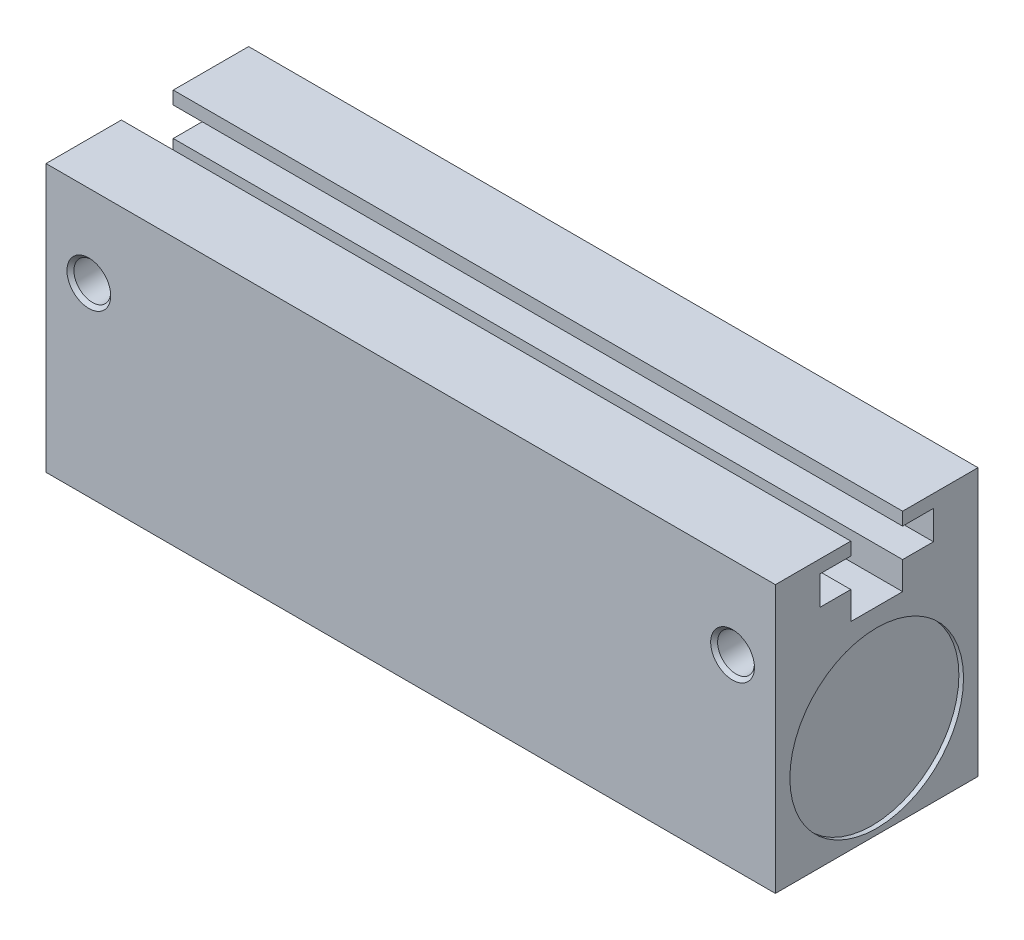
ISO-10303-21;
HEADER;
FILE_DESCRIPTION(('STEP AP214'),'2;1');
FILE_NAME('part.step','',(''),(''),'','','');
FILE_SCHEMA(('AUTOMOTIVE_DESIGN { 1 0 10303 214 1 1 1 1 }'));
ENDSEC;
DATA;
#1=APPLICATION_CONTEXT('core data for automotive mechanical design processes');
#2=APPLICATION_PROTOCOL_DEFINITION('international standard','automotive_design',2000,#1);
#3=PRODUCT_CONTEXT('',#1,'mechanical');
#4=PRODUCT('Part','Part','',(#3));
#5=PRODUCT_RELATED_PRODUCT_CATEGORY('part','',(#4));
#6=PRODUCT_DEFINITION_FORMATION('','',#4);
#7=PRODUCT_DEFINITION_CONTEXT('part definition',#1,'design');
#8=PRODUCT_DEFINITION('design','',#6,#7);
#9=PRODUCT_DEFINITION_SHAPE('','',#8);
#10=(LENGTH_UNIT() NAMED_UNIT(*) SI_UNIT(.MILLI.,.METRE.));
#11=(NAMED_UNIT(*) PLANE_ANGLE_UNIT() SI_UNIT($,.RADIAN.));
#12=(NAMED_UNIT(*) SI_UNIT($,.STERADIAN.) SOLID_ANGLE_UNIT());
#13=UNCERTAINTY_MEASURE_WITH_UNIT(LENGTH_MEASURE(1.E-05),#10,'distance_accuracy_value','');
#14=(GEOMETRIC_REPRESENTATION_CONTEXT(3) GLOBAL_UNCERTAINTY_ASSIGNED_CONTEXT((#13)) GLOBAL_UNIT_ASSIGNED_CONTEXT((#10,
#11,#12)) REPRESENTATION_CONTEXT('',''));
#15=CARTESIAN_POINT('',(0.,0.,0.));
#16=DIRECTION('',(0.,0.,1.));
#17=DIRECTION('',(1.,0.,0.));
#18=AXIS2_PLACEMENT_3D('',#15,#16,#17);
#19=CARTESIAN_POINT('',(-40.005,-14.6685,11.1125));
#20=DIRECTION('',(1.,0.,0.));
#21=DIRECTION('',(0.,0.,-1.));
#22=AXIS2_PLACEMENT_3D('',#19,#20,#21);
#23=PLANE('',#22);
#24=DIRECTION('',(0.,-1.,0.));
#25=VECTOR('',#24,1.);
#26=CARTESIAN_POINT('',(-40.005,14.6685,11.1125));
#27=LINE('',#26,#25);
#28=CARTESIAN_POINT('',(-40.005,14.6685,11.1125));
#29=VERTEX_POINT('',#28);
#30=CARTESIAN_POINT('',(-40.005,-14.6685,11.1125));
#31=VERTEX_POINT('',#30);
#32=EDGE_CURVE('E186',#29,#31,#27,.T.);
#33=ORIENTED_EDGE('',*,*,#32,.F.);
#34=DIRECTION('',(0.,0.,1.));
#35=VECTOR('',#34,1.);
#36=CARTESIAN_POINT('',(-40.005,14.6685,2.8448));
#37=LINE('',#36,#35);
#38=CARTESIAN_POINT('',(-40.005,14.6685,2.8448));
#39=VERTEX_POINT('',#38);
#40=EDGE_CURVE('E114',#39,#29,#37,.T.);
#41=ORIENTED_EDGE('',*,*,#40,.F.);
#42=DIRECTION('',(0.,1.,0.));
#43=VECTOR('',#42,1.);
#44=CARTESIAN_POINT('',(-40.005,13.2461,2.8448));
#45=LINE('',#44,#43);
#46=CARTESIAN_POINT('',(-40.005,13.2461,2.8448));
#47=VERTEX_POINT('',#46);
#48=EDGE_CURVE('E108',#47,#39,#45,.T.);
#49=ORIENTED_EDGE('',*,*,#48,.F.);
#50=DIRECTION('',(0.,0.,-1.));
#51=VECTOR('',#50,1.);
#52=CARTESIAN_POINT('',(-40.005,13.2461,6.223));
#53=LINE('',#52,#51);
#54=CARTESIAN_POINT('',(-40.005,13.2461,6.223));
#55=VERTEX_POINT('',#54);
#56=EDGE_CURVE('E176',#55,#47,#53,.T.);
#57=ORIENTED_EDGE('',*,*,#56,.F.);
#58=DIRECTION('',(0.,1.,0.));
#59=VECTOR('',#58,1.);
#60=CARTESIAN_POINT('',(-40.005,10.0711,6.223));
#61=LINE('',#60,#59);
#62=CARTESIAN_POINT('',(-40.005,10.0711,6.223));
#63=VERTEX_POINT('',#62);
#64=EDGE_CURVE('E212',#63,#55,#61,.T.);
#65=ORIENTED_EDGE('',*,*,#64,.F.);
#66=DIRECTION('',(0.,0.,1.));
#67=VECTOR('',#66,1.);
#68=CARTESIAN_POINT('',(-40.005,10.0711,2.8448));
#69=LINE('',#68,#67);
#70=CARTESIAN_POINT('',(-40.005,10.0711,2.8448));
#71=VERTEX_POINT('',#70);
#72=EDGE_CURVE('E210',#71,#63,#69,.T.);
#73=ORIENTED_EDGE('',*,*,#72,.F.);
#74=DIRECTION('',(0.,1.,0.));
#75=VECTOR('',#74,1.);
#76=CARTESIAN_POINT('',(-40.005,7.0231,2.8448));
#77=LINE('',#76,#75);
#78=CARTESIAN_POINT('',(-40.005,7.0231,2.8448));
#79=VERTEX_POINT('',#78);
#80=EDGE_CURVE('E208',#79,#71,#77,.T.);
#81=ORIENTED_EDGE('',*,*,#80,.F.);
#82=DIRECTION('',(0.,0.,1.));
#83=VECTOR('',#82,1.);
#84=CARTESIAN_POINT('',(-40.005,7.0231,-2.8448));
#85=LINE('',#84,#83);
#86=CARTESIAN_POINT('',(-40.005,7.0231,-2.8448));
#87=VERTEX_POINT('',#86);
#88=EDGE_CURVE('E206',#87,#79,#85,.T.);
#89=ORIENTED_EDGE('',*,*,#88,.F.);
#90=DIRECTION('',(0.,-1.,0.));
#91=VECTOR('',#90,1.);
#92=CARTESIAN_POINT('',(-40.005,10.0711,-2.8448));
#93=LINE('',#92,#91);
#94=CARTESIAN_POINT('',(-40.005,10.0711,-2.8448));
#95=VERTEX_POINT('',#94);
#96=EDGE_CURVE('E204',#95,#87,#93,.T.);
#97=ORIENTED_EDGE('',*,*,#96,.F.);
#98=DIRECTION('',(0.,0.,1.));
#99=VECTOR('',#98,1.);
#100=CARTESIAN_POINT('',(-40.005,10.0711,-6.223));
#101=LINE('',#100,#99);
#102=CARTESIAN_POINT('',(-40.005,10.0711,-6.223));
#103=VERTEX_POINT('',#102);
#104=EDGE_CURVE('E202',#103,#95,#101,.T.);
#105=ORIENTED_EDGE('',*,*,#104,.F.);
#106=DIRECTION('',(0.,-1.,0.));
#107=VECTOR('',#106,1.);
#108=CARTESIAN_POINT('',(-40.005,13.2461,-6.223));
#109=LINE('',#108,#107);
#110=CARTESIAN_POINT('',(-40.005,13.2461,-6.223));
#111=VERTEX_POINT('',#110);
#112=EDGE_CURVE('E200',#111,#103,#109,.T.);
#113=ORIENTED_EDGE('',*,*,#112,.F.);
#114=DIRECTION('',(0.,0.,-1.));
#115=VECTOR('',#114,1.);
#116=CARTESIAN_POINT('',(-40.005,13.2461,-2.8448));
#117=LINE('',#116,#115);
#118=CARTESIAN_POINT('',(-40.005,13.2461,-2.8448));
#119=VERTEX_POINT('',#118);
#120=EDGE_CURVE('E198',#119,#111,#117,.T.);
#121=ORIENTED_EDGE('',*,*,#120,.F.);
#122=DIRECTION('',(0.,-1.,0.));
#123=VECTOR('',#122,1.);
#124=CARTESIAN_POINT('',(-40.005,14.6685,-2.8448));
#125=LINE('',#124,#123);
#126=CARTESIAN_POINT('',(-40.005,14.6685,-2.8448));
#127=VERTEX_POINT('',#126);
#128=EDGE_CURVE('E196',#127,#119,#125,.T.);
#129=ORIENTED_EDGE('',*,*,#128,.F.);
#130=DIRECTION('',(0.,0.,1.));
#131=VECTOR('',#130,1.);
#132=CARTESIAN_POINT('',(-40.005,14.6685,-11.1125));
#133=LINE('',#132,#131);
#134=CARTESIAN_POINT('',(-40.005,14.6685,-11.1125));
#135=VERTEX_POINT('',#134);
#136=EDGE_CURVE('E194',#135,#127,#133,.T.);
#137=ORIENTED_EDGE('',*,*,#136,.F.);
#138=DIRECTION('',(0.,1.,0.));
#139=VECTOR('',#138,1.);
#140=CARTESIAN_POINT('',(-40.005,-14.6685,-11.1125));
#141=LINE('',#140,#139);
#142=CARTESIAN_POINT('',(-40.005,-14.6685,-11.1125));
#143=VERTEX_POINT('',#142);
#144=EDGE_CURVE('E192',#143,#135,#141,.T.);
#145=ORIENTED_EDGE('',*,*,#144,.F.);
#146=DIRECTION('',(0.,0.,-1.));
#147=VECTOR('',#146,1.);
#148=CARTESIAN_POINT('',(-40.005,-14.6685,11.1125));
#149=LINE('',#148,#147);
#150=EDGE_CURVE('E189',#31,#143,#149,.T.);
#151=ORIENTED_EDGE('',*,*,#150,.F.);
#152=EDGE_LOOP('',(#33,#41,#49,#57,#65,#73,#81,#89,#97,#105,#113,#121,#129,#137,#145,#151));
#153=FACE_BOUND('',#152,.T.);
#154=CARTESIAN_POINT('',(-40.005,-4.5085,0.));
#155=DIRECTION('',(1.,0.,0.));
#156=DIRECTION('',(0.,0.,-1.));
#157=AXIS2_PLACEMENT_3D('',#154,#155,#156);
#158=CIRCLE('',#157,9.525);
#159=CARTESIAN_POINT('',(-40.005,-4.5085,-9.525));
#160=VERTEX_POINT('',#159);
#161=EDGE_CURVE('E319',#160,#160,#158,.T.);
#162=ORIENTED_EDGE('',*,*,#161,.T.);
#163=EDGE_LOOP('',(#162));
#164=FACE_BOUND('',#163,.T.);
#165=ADVANCED_FACE('F37',(#153,#164),#23,.F.);
#166=CARTESIAN_POINT('',(40.005,14.6685,11.1125));
#167=DIRECTION('',(0.,0.,-1.));
#168=DIRECTION('',(0.,1.,0.));
#169=AXIS2_PLACEMENT_3D('',#166,#167,#168);
#170=PLANE('',#169);
#171=CARTESIAN_POINT('',(35.306,5.65149999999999,11.1125));
#172=DIRECTION('',(0.,0.,-1.));
#173=DIRECTION('',(0.,1.,0.));
#174=AXIS2_PLACEMENT_3D('',#171,#172,#173);
#175=CIRCLE('',#174,2.40029999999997);
#176=CARTESIAN_POINT('',(35.306,8.05179999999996,11.1125));
#177=VERTEX_POINT('',#176);
#178=EDGE_CURVE('E46',#177,#177,#175,.T.);
#179=ORIENTED_EDGE('',*,*,#178,.T.);
#180=EDGE_LOOP('',(#179));
#181=FACE_BOUND('',#180,.T.);
#182=CARTESIAN_POINT('',(-35.306,5.6515,11.1125));
#183=DIRECTION('',(0.,0.,-1.));
#184=DIRECTION('',(0.,1.,0.));
#185=AXIS2_PLACEMENT_3D('',#182,#183,#184);
#186=CIRCLE('',#185,2.40029999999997);
#187=CARTESIAN_POINT('',(-35.306,8.05179999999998,11.1125));
#188=VERTEX_POINT('',#187);
#189=EDGE_CURVE('E283',#188,#188,#186,.T.);
#190=ORIENTED_EDGE('',*,*,#189,.T.);
#191=EDGE_LOOP('',(#190));
#192=FACE_BOUND('',#191,.T.);
#193=ORIENTED_EDGE('',*,*,#32,.T.);
#194=DIRECTION('',(-1.,0.,0.));
#195=VECTOR('',#194,1.);
#196=CARTESIAN_POINT('',(40.005,-14.6685,11.1125));
#197=LINE('',#196,#195);
#198=CARTESIAN_POINT('',(40.005,-14.6685,11.1125));
#199=VERTEX_POINT('',#198);
#200=EDGE_CURVE('E254',#199,#31,#197,.T.);
#201=ORIENTED_EDGE('',*,*,#200,.F.);
#202=DIRECTION('',(0.,-1.,0.));
#203=VECTOR('',#202,1.);
#204=CARTESIAN_POINT('',(40.005,14.6685,11.1125));
#205=LINE('',#204,#203);
#206=CARTESIAN_POINT('',(40.005,14.6685,11.1125));
#207=VERTEX_POINT('',#206);
#208=EDGE_CURVE('E217',#207,#199,#205,.T.);
#209=ORIENTED_EDGE('',*,*,#208,.F.);
#210=DIRECTION('',(-1.,0.,0.));
#211=VECTOR('',#210,1.);
#212=CARTESIAN_POINT('',(40.005,14.6685,11.1125));
#213=LINE('',#212,#211);
#214=EDGE_CURVE('E182',#207,#29,#213,.T.);
#215=ORIENTED_EDGE('',*,*,#214,.T.);
#216=EDGE_LOOP('',(#193,#201,#209,#215));
#217=FACE_BOUND('',#216,.T.);
#218=ADVANCED_FACE('F288',(#181,#192,#217),#170,.F.);
#219=CARTESIAN_POINT('',(40.005,-14.6685,11.1125));
#220=DIRECTION('',(0.,1.,0.));
#221=DIRECTION('',(0.,0.,1.));
#222=AXIS2_PLACEMENT_3D('',#219,#220,#221);
#223=PLANE('',#222);
#224=CARTESIAN_POINT('',(12.7,-14.6685,8.3312));
#225=DIRECTION('',(0.,1.,0.));
#226=DIRECTION('',(0.,0.,1.));
#227=AXIS2_PLACEMENT_3D('',#224,#225,#226);
#228=CIRCLE('',#227,1.67005000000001);
#229=CARTESIAN_POINT('',(12.7,-14.6685,10.00125));
#230=VERTEX_POINT('',#229);
#231=EDGE_CURVE('E268',#230,#230,#228,.T.);
#232=ORIENTED_EDGE('',*,*,#231,.T.);
#233=EDGE_LOOP('',(#232));
#234=FACE_BOUND('',#233,.T.);
#235=CARTESIAN_POINT('',(12.7,-14.6685,-8.3312));
#236=DIRECTION('',(0.,1.,0.));
#237=DIRECTION('',(0.,0.,1.));
#238=AXIS2_PLACEMENT_3D('',#235,#236,#237);
#239=CIRCLE('',#238,1.67005000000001);
#240=CARTESIAN_POINT('',(12.7,-14.6685,-6.66114999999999));
#241=VERTEX_POINT('',#240);
#242=EDGE_CURVE('E265',#241,#241,#239,.T.);
#243=ORIENTED_EDGE('',*,*,#242,.T.);
#244=EDGE_LOOP('',(#243));
#245=FACE_BOUND('',#244,.T.);
#246=CARTESIAN_POINT('',(-12.7,-14.6685,-8.3312));
#247=DIRECTION('',(0.,1.,0.));
#248=DIRECTION('',(0.,0.,1.));
#249=AXIS2_PLACEMENT_3D('',#246,#247,#248);
#250=CIRCLE('',#249,1.67005000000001);
#251=CARTESIAN_POINT('',(-12.7,-14.6685,-6.66114999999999));
#252=VERTEX_POINT('',#251);
#253=EDGE_CURVE('E262',#252,#252,#250,.T.);
#254=ORIENTED_EDGE('',*,*,#253,.T.);
#255=EDGE_LOOP('',(#254));
#256=FACE_BOUND('',#255,.T.);
#257=CARTESIAN_POINT('',(-12.7,-14.6685,8.3312));
#258=DIRECTION('',(0.,1.,0.));
#259=DIRECTION('',(0.,0.,1.));
#260=AXIS2_PLACEMENT_3D('',#257,#258,#259);
#261=CIRCLE('',#260,1.67005000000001);
#262=CARTESIAN_POINT('',(-12.7,-14.6685,10.00125));
#263=VERTEX_POINT('',#262);
#264=EDGE_CURVE('E259',#263,#263,#261,.T.);
#265=ORIENTED_EDGE('',*,*,#264,.T.);
#266=EDGE_LOOP('',(#265));
#267=FACE_BOUND('',#266,.T.);
#268=CARTESIAN_POINT('',(0.,-14.6685,-8.3312));
#269=DIRECTION('',(0.,-1.,0.));
#270=DIRECTION('',(0.,0.,-1.));
#271=AXIS2_PLACEMENT_3D('',#268,#269,#270);
#272=CIRCLE('',#271,1.5875);
#273=CARTESIAN_POINT('',(0.,-14.6685,-9.9187));
#274=VERTEX_POINT('',#273);
#275=EDGE_CURVE('E467',#274,#274,#272,.T.);
#276=ORIENTED_EDGE('',*,*,#275,.F.);
#277=EDGE_LOOP('',(#276));
#278=FACE_BOUND('',#277,.T.);
#279=CARTESIAN_POINT('',(0.,-14.6685,8.3312));
#280=DIRECTION('',(0.,-1.,0.));
#281=DIRECTION('',(0.,0.,-1.));
#282=AXIS2_PLACEMENT_3D('',#279,#280,#281);
#283=CIRCLE('',#282,1.5875);
#284=CARTESIAN_POINT('',(0.,-14.6685,6.7437));
#285=VERTEX_POINT('',#284);
#286=EDGE_CURVE('E470',#285,#285,#283,.T.);
#287=ORIENTED_EDGE('',*,*,#286,.F.);
#288=EDGE_LOOP('',(#287));
#289=FACE_BOUND('',#288,.T.);
#290=ORIENTED_EDGE('',*,*,#150,.T.);
#291=DIRECTION('',(-1.,0.,0.));
#292=VECTOR('',#291,1.);
#293=CARTESIAN_POINT('',(40.005,-14.6685,-11.1125));
#294=LINE('',#293,#292);
#295=CARTESIAN_POINT('',(40.005,-14.6685,-11.1125));
#296=VERTEX_POINT('',#295);
#297=EDGE_CURVE('E251',#296,#143,#294,.T.);
#298=ORIENTED_EDGE('',*,*,#297,.F.);
#299=DIRECTION('',(0.,0.,-1.));
#300=VECTOR('',#299,1.);
#301=CARTESIAN_POINT('',(40.005,-14.6685,11.1125));
#302=LINE('',#301,#300);
#303=EDGE_CURVE('E123',#199,#296,#302,.T.);
#304=ORIENTED_EDGE('',*,*,#303,.F.);
#305=ORIENTED_EDGE('',*,*,#200,.T.);
#306=EDGE_LOOP('',(#290,#298,#304,#305));
#307=FACE_BOUND('',#306,.T.);
#308=ADVANCED_FACE('F379',(#234,#245,#256,#267,#278,#289,#307),#223,.F.);
#309=CARTESIAN_POINT('',(40.005,-14.6685,-11.1125));
#310=DIRECTION('',(0.,0.,1.));
#311=DIRECTION('',(0.,-1.,0.));
#312=AXIS2_PLACEMENT_3D('',#309,#310,#311);
#313=PLANE('',#312);
#314=ORIENTED_EDGE('',*,*,#144,.T.);
#315=DIRECTION('',(-1.,0.,0.));
#316=VECTOR('',#315,1.);
#317=CARTESIAN_POINT('',(40.005,14.6685,-11.1125));
#318=LINE('',#317,#316);
#319=CARTESIAN_POINT('',(40.005,14.6685,-11.1125));
#320=VERTEX_POINT('',#319);
#321=EDGE_CURVE('E248',#320,#135,#318,.T.);
#322=ORIENTED_EDGE('',*,*,#321,.F.);
#323=DIRECTION('',(0.,1.,0.));
#324=VECTOR('',#323,1.);
#325=CARTESIAN_POINT('',(40.005,-14.6685,-11.1125));
#326=LINE('',#325,#324);
#327=EDGE_CURVE('E327',#296,#320,#326,.T.);
#328=ORIENTED_EDGE('',*,*,#327,.F.);
#329=ORIENTED_EDGE('',*,*,#297,.T.);
#330=EDGE_LOOP('',(#314,#322,#328,#329));
#331=FACE_BOUND('',#330,.T.);
#332=ADVANCED_FACE('F505',(#331),#313,.F.);
#333=CARTESIAN_POINT('',(40.005,14.6685,-11.1125));
#334=DIRECTION('',(0.,-1.,0.));
#335=DIRECTION('',(0.,0.,-1.));
#336=AXIS2_PLACEMENT_3D('',#333,#334,#335);
#337=PLANE('',#336);
#338=ORIENTED_EDGE('',*,*,#136,.T.);
#339=DIRECTION('',(-1.,0.,0.));
#340=VECTOR('',#339,1.);
#341=CARTESIAN_POINT('',(40.005,14.6685,-2.8448));
#342=LINE('',#341,#340);
#343=CARTESIAN_POINT('',(40.005,14.6685,-2.8448));
#344=VERTEX_POINT('',#343);
#345=EDGE_CURVE('E245',#344,#127,#342,.T.);
#346=ORIENTED_EDGE('',*,*,#345,.F.);
#347=DIRECTION('',(0.,0.,1.));
#348=VECTOR('',#347,1.);
#349=CARTESIAN_POINT('',(40.005,14.6685,-11.1125));
#350=LINE('',#349,#348);
#351=EDGE_CURVE('E329',#320,#344,#350,.T.);
#352=ORIENTED_EDGE('',*,*,#351,.F.);
#353=ORIENTED_EDGE('',*,*,#321,.T.);
#354=EDGE_LOOP('',(#338,#346,#352,#353));
#355=FACE_BOUND('',#354,.T.);
#356=ADVANCED_FACE('F516',(#355),#337,.F.);
#357=CARTESIAN_POINT('',(40.005,14.6685,-2.8448));
#358=DIRECTION('',(0.,0.,-1.));
#359=DIRECTION('',(-1.,0.,0.));
#360=AXIS2_PLACEMENT_3D('',#357,#358,#359);
#361=PLANE('',#360);
#362=ORIENTED_EDGE('',*,*,#128,.T.);
#363=DIRECTION('',(-1.,0.,0.));
#364=VECTOR('',#363,1.);
#365=CARTESIAN_POINT('',(40.005,13.2461,-2.8448));
#366=LINE('',#365,#364);
#367=CARTESIAN_POINT('',(40.005,13.2461,-2.8448));
#368=VERTEX_POINT('',#367);
#369=EDGE_CURVE('E242',#368,#119,#366,.T.);
#370=ORIENTED_EDGE('',*,*,#369,.F.);
#371=DIRECTION('',(0.,-1.,0.));
#372=VECTOR('',#371,1.);
#373=CARTESIAN_POINT('',(40.005,14.6685,-2.8448));
#374=LINE('',#373,#372);
#375=EDGE_CURVE('E331',#344,#368,#374,.T.);
#376=ORIENTED_EDGE('',*,*,#375,.F.);
#377=ORIENTED_EDGE('',*,*,#345,.T.);
#378=EDGE_LOOP('',(#362,#370,#376,#377));
#379=FACE_BOUND('',#378,.T.);
#380=ADVANCED_FACE('F520',(#379),#361,.F.);
#381=CARTESIAN_POINT('',(40.005,13.2461,-2.8448));
#382=DIRECTION('',(0.,1.,0.));
#383=DIRECTION('',(0.,0.,1.));
#384=AXIS2_PLACEMENT_3D('',#381,#382,#383);
#385=PLANE('',#384);
#386=ORIENTED_EDGE('',*,*,#120,.T.);
#387=DIRECTION('',(-1.,0.,0.));
#388=VECTOR('',#387,1.);
#389=CARTESIAN_POINT('',(40.005,13.2461,-6.223));
#390=LINE('',#389,#388);
#391=CARTESIAN_POINT('',(40.005,13.2461,-6.223));
#392=VERTEX_POINT('',#391);
#393=EDGE_CURVE('E239',#392,#111,#390,.T.);
#394=ORIENTED_EDGE('',*,*,#393,.F.);
#395=DIRECTION('',(0.,0.,-1.));
#396=VECTOR('',#395,1.);
#397=CARTESIAN_POINT('',(40.005,13.2461,-2.8448));
#398=LINE('',#397,#396);
#399=EDGE_CURVE('E333',#368,#392,#398,.T.);
#400=ORIENTED_EDGE('',*,*,#399,.F.);
#401=ORIENTED_EDGE('',*,*,#369,.T.);
#402=EDGE_LOOP('',(#386,#394,#400,#401));
#403=FACE_BOUND('',#402,.T.);
#404=ADVANCED_FACE('F527',(#403),#385,.F.);
#405=CARTESIAN_POINT('',(40.005,13.2461,-6.223));
#406=DIRECTION('',(0.,0.,-1.));
#407=DIRECTION('',(-1.,0.,0.));
#408=AXIS2_PLACEMENT_3D('',#405,#406,#407);
#409=PLANE('',#408);
#410=ORIENTED_EDGE('',*,*,#112,.T.);
#411=DIRECTION('',(-1.,0.,0.));
#412=VECTOR('',#411,1.);
#413=CARTESIAN_POINT('',(40.005,10.0711,-6.223));
#414=LINE('',#413,#412);
#415=CARTESIAN_POINT('',(40.005,10.0711,-6.223));
#416=VERTEX_POINT('',#415);
#417=EDGE_CURVE('E236',#416,#103,#414,.T.);
#418=ORIENTED_EDGE('',*,*,#417,.F.);
#419=DIRECTION('',(0.,-1.,0.));
#420=VECTOR('',#419,1.);
#421=CARTESIAN_POINT('',(40.005,13.2461,-6.223));
#422=LINE('',#421,#420);
#423=EDGE_CURVE('E335',#392,#416,#422,.T.);
#424=ORIENTED_EDGE('',*,*,#423,.F.);
#425=ORIENTED_EDGE('',*,*,#393,.T.);
#426=EDGE_LOOP('',(#410,#418,#424,#425));
#427=FACE_BOUND('',#426,.T.);
#428=ADVANCED_FACE('F530',(#427),#409,.F.);
#429=CARTESIAN_POINT('',(40.005,10.0711,-6.223));
#430=DIRECTION('',(0.,-1.,0.));
#431=DIRECTION('',(0.,0.,-1.));
#432=AXIS2_PLACEMENT_3D('',#429,#430,#431);
#433=PLANE('',#432);
#434=ORIENTED_EDGE('',*,*,#104,.T.);
#435=DIRECTION('',(-1.,0.,0.));
#436=VECTOR('',#435,1.);
#437=CARTESIAN_POINT('',(40.005,10.0711,-2.8448));
#438=LINE('',#437,#436);
#439=CARTESIAN_POINT('',(40.005,10.0711,-2.8448));
#440=VERTEX_POINT('',#439);
#441=EDGE_CURVE('E233',#440,#95,#438,.T.);
#442=ORIENTED_EDGE('',*,*,#441,.F.);
#443=DIRECTION('',(0.,0.,1.));
#444=VECTOR('',#443,1.);
#445=CARTESIAN_POINT('',(40.005,10.0711,-6.223));
#446=LINE('',#445,#444);
#447=EDGE_CURVE('E337',#416,#440,#446,.T.);
#448=ORIENTED_EDGE('',*,*,#447,.F.);
#449=ORIENTED_EDGE('',*,*,#417,.T.);
#450=EDGE_LOOP('',(#434,#442,#448,#449));
#451=FACE_BOUND('',#450,.T.);
#452=ADVANCED_FACE('F535',(#451),#433,.F.);
#453=CARTESIAN_POINT('',(40.005,10.0711,-2.8448));
#454=DIRECTION('',(0.,0.,-1.));
#455=DIRECTION('',(-1.,0.,0.));
#456=AXIS2_PLACEMENT_3D('',#453,#454,#455);
#457=PLANE('',#456);
#458=ORIENTED_EDGE('',*,*,#96,.T.);
#459=DIRECTION('',(-1.,0.,0.));
#460=VECTOR('',#459,1.);
#461=CARTESIAN_POINT('',(40.005,7.0231,-2.8448));
#462=LINE('',#461,#460);
#463=CARTESIAN_POINT('',(40.005,7.0231,-2.8448));
#464=VERTEX_POINT('',#463);
#465=EDGE_CURVE('E230',#464,#87,#462,.T.);
#466=ORIENTED_EDGE('',*,*,#465,.F.);
#467=DIRECTION('',(0.,-1.,0.));
#468=VECTOR('',#467,1.);
#469=CARTESIAN_POINT('',(40.005,10.0711,-2.8448));
#470=LINE('',#469,#468);
#471=EDGE_CURVE('E339',#440,#464,#470,.T.);
#472=ORIENTED_EDGE('',*,*,#471,.F.);
#473=ORIENTED_EDGE('',*,*,#441,.T.);
#474=EDGE_LOOP('',(#458,#466,#472,#473));
#475=FACE_BOUND('',#474,.T.);
#476=ADVANCED_FACE('F541',(#475),#457,.F.);
#477=CARTESIAN_POINT('',(40.005,7.0231,-2.8448));
#478=DIRECTION('',(0.,-1.,0.));
#479=DIRECTION('',(0.,0.,-1.));
#480=AXIS2_PLACEMENT_3D('',#477,#478,#479);
#481=PLANE('',#480);
#482=ORIENTED_EDGE('',*,*,#88,.T.);
#483=DIRECTION('',(-1.,0.,0.));
#484=VECTOR('',#483,1.);
#485=CARTESIAN_POINT('',(40.005,7.0231,2.8448));
#486=LINE('',#485,#484);
#487=CARTESIAN_POINT('',(40.005,7.0231,2.8448));
#488=VERTEX_POINT('',#487);
#489=EDGE_CURVE('E227',#488,#79,#486,.T.);
#490=ORIENTED_EDGE('',*,*,#489,.F.);
#491=DIRECTION('',(0.,0.,1.));
#492=VECTOR('',#491,1.);
#493=CARTESIAN_POINT('',(40.005,7.0231,-2.8448));
#494=LINE('',#493,#492);
#495=EDGE_CURVE('E341',#464,#488,#494,.T.);
#496=ORIENTED_EDGE('',*,*,#495,.F.);
#497=ORIENTED_EDGE('',*,*,#465,.T.);
#498=EDGE_LOOP('',(#482,#490,#496,#497));
#499=FACE_BOUND('',#498,.T.);
#500=ADVANCED_FACE('F545',(#499),#481,.F.);
#501=CARTESIAN_POINT('',(40.005,7.0231,2.8448));
#502=DIRECTION('',(0.,0.,1.));
#503=DIRECTION('',(1.,0.,0.));
#504=AXIS2_PLACEMENT_3D('',#501,#502,#503);
#505=PLANE('',#504);
#506=ORIENTED_EDGE('',*,*,#80,.T.);
#507=DIRECTION('',(-1.,0.,0.));
#508=VECTOR('',#507,1.);
#509=CARTESIAN_POINT('',(40.005,10.0711,2.8448));
#510=LINE('',#509,#508);
#511=CARTESIAN_POINT('',(40.005,10.0711,2.8448));
#512=VERTEX_POINT('',#511);
#513=EDGE_CURVE('E224',#512,#71,#510,.T.);
#514=ORIENTED_EDGE('',*,*,#513,.F.);
#515=DIRECTION('',(0.,1.,0.));
#516=VECTOR('',#515,1.);
#517=CARTESIAN_POINT('',(40.005,7.0231,2.8448));
#518=LINE('',#517,#516);
#519=EDGE_CURVE('E343',#488,#512,#518,.T.);
#520=ORIENTED_EDGE('',*,*,#519,.F.);
#521=ORIENTED_EDGE('',*,*,#489,.T.);
#522=EDGE_LOOP('',(#506,#514,#520,#521));
#523=FACE_BOUND('',#522,.T.);
#524=ADVANCED_FACE('F548',(#523),#505,.F.);
#525=CARTESIAN_POINT('',(40.005,10.0711,2.8448));
#526=DIRECTION('',(0.,-1.,0.));
#527=DIRECTION('',(0.,0.,-1.));
#528=AXIS2_PLACEMENT_3D('',#525,#526,#527);
#529=PLANE('',#528);
#530=ORIENTED_EDGE('',*,*,#72,.T.);
#531=DIRECTION('',(-1.,0.,0.));
#532=VECTOR('',#531,1.);
#533=CARTESIAN_POINT('',(40.005,10.0711,6.223));
#534=LINE('',#533,#532);
#535=CARTESIAN_POINT('',(40.005,10.0711,6.223));
#536=VERTEX_POINT('',#535);
#537=EDGE_CURVE('E221',#536,#63,#534,.T.);
#538=ORIENTED_EDGE('',*,*,#537,.F.);
#539=DIRECTION('',(0.,0.,1.));
#540=VECTOR('',#539,1.);
#541=CARTESIAN_POINT('',(40.005,10.0711,2.8448));
#542=LINE('',#541,#540);
#543=EDGE_CURVE('E345',#512,#536,#542,.T.);
#544=ORIENTED_EDGE('',*,*,#543,.F.);
#545=ORIENTED_EDGE('',*,*,#513,.T.);
#546=EDGE_LOOP('',(#530,#538,#544,#545));
#547=FACE_BOUND('',#546,.T.);
#548=ADVANCED_FACE('F351',(#547),#529,.F.);
#549=CARTESIAN_POINT('',(40.005,10.0711,6.223));
#550=DIRECTION('',(0.,0.,1.));
#551=DIRECTION('',(1.,0.,0.));
#552=AXIS2_PLACEMENT_3D('',#549,#550,#551);
#553=PLANE('',#552);
#554=ORIENTED_EDGE('',*,*,#64,.T.);
#555=DIRECTION('',(-1.,0.,0.));
#556=VECTOR('',#555,1.);
#557=CARTESIAN_POINT('',(40.005,13.2461,6.223));
#558=LINE('',#557,#556);
#559=CARTESIAN_POINT('',(40.005,13.2461,6.223));
#560=VERTEX_POINT('',#559);
#561=EDGE_CURVE('E177',#560,#55,#558,.T.);
#562=ORIENTED_EDGE('',*,*,#561,.F.);
#563=DIRECTION('',(0.,1.,0.));
#564=VECTOR('',#563,1.);
#565=CARTESIAN_POINT('',(40.005,10.0711,6.223));
#566=LINE('',#565,#564);
#567=EDGE_CURVE('E168',#536,#560,#566,.T.);
#568=ORIENTED_EDGE('',*,*,#567,.F.);
#569=ORIENTED_EDGE('',*,*,#537,.T.);
#570=EDGE_LOOP('',(#554,#562,#568,#569));
#571=FACE_BOUND('',#570,.T.);
#572=ADVANCED_FACE('F355',(#571),#553,.F.);
#573=CARTESIAN_POINT('',(40.005,13.2461,6.223));
#574=DIRECTION('',(0.,1.,0.));
#575=DIRECTION('',(0.,0.,1.));
#576=AXIS2_PLACEMENT_3D('',#573,#574,#575);
#577=PLANE('',#576);
#578=ORIENTED_EDGE('',*,*,#56,.T.);
#579=DIRECTION('',(-1.,0.,0.));
#580=VECTOR('',#579,1.);
#581=CARTESIAN_POINT('',(40.005,13.2461,2.8448));
#582=LINE('',#581,#580);
#583=CARTESIAN_POINT('',(40.005,13.2461,2.8448));
#584=VERTEX_POINT('',#583);
#585=EDGE_CURVE('E173',#584,#47,#582,.T.);
#586=ORIENTED_EDGE('',*,*,#585,.F.);
#587=DIRECTION('',(0.,0.,-1.));
#588=VECTOR('',#587,1.);
#589=CARTESIAN_POINT('',(40.005,13.2461,6.223));
#590=LINE('',#589,#588);
#591=EDGE_CURVE('E162',#560,#584,#590,.T.);
#592=ORIENTED_EDGE('',*,*,#591,.F.);
#593=ORIENTED_EDGE('',*,*,#561,.T.);
#594=EDGE_LOOP('',(#578,#586,#592,#593));
#595=FACE_BOUND('',#594,.T.);
#596=ADVANCED_FACE('F174',(#595),#577,.F.);
#597=CARTESIAN_POINT('',(40.005,13.2461,2.8448));
#598=DIRECTION('',(0.,0.,1.));
#599=DIRECTION('',(1.,0.,0.));
#600=AXIS2_PLACEMENT_3D('',#597,#598,#599);
#601=PLANE('',#600);
#602=ORIENTED_EDGE('',*,*,#48,.T.);
#603=DIRECTION('',(-1.,0.,0.));
#604=VECTOR('',#603,1.);
#605=CARTESIAN_POINT('',(40.005,14.6685,2.8448));
#606=LINE('',#605,#604);
#607=CARTESIAN_POINT('',(40.005,14.6685,2.8448));
#608=VERTEX_POINT('',#607);
#609=EDGE_CURVE('E178',#608,#39,#606,.T.);
#610=ORIENTED_EDGE('',*,*,#609,.F.);
#611=DIRECTION('',(0.,1.,0.));
#612=VECTOR('',#611,1.);
#613=CARTESIAN_POINT('',(40.005,13.2461,2.8448));
#614=LINE('',#613,#612);
#615=EDGE_CURVE('E166',#584,#608,#614,.T.);
#616=ORIENTED_EDGE('',*,*,#615,.F.);
#617=ORIENTED_EDGE('',*,*,#585,.T.);
#618=EDGE_LOOP('',(#602,#610,#616,#617));
#619=FACE_BOUND('',#618,.T.);
#620=ADVANCED_FACE('F180',(#619),#601,.F.);
#621=CARTESIAN_POINT('',(40.005,14.6685,2.8448));
#622=DIRECTION('',(0.,-1.,0.));
#623=DIRECTION('',(0.,0.,-1.));
#624=AXIS2_PLACEMENT_3D('',#621,#622,#623);
#625=PLANE('',#624);
#626=ORIENTED_EDGE('',*,*,#40,.T.);
#627=ORIENTED_EDGE('',*,*,#214,.F.);
#628=DIRECTION('',(0.,0.,1.));
#629=VECTOR('',#628,1.);
#630=CARTESIAN_POINT('',(40.005,14.6685,2.8448));
#631=LINE('',#630,#629);
#632=EDGE_CURVE('E54',#608,#207,#631,.T.);
#633=ORIENTED_EDGE('',*,*,#632,.F.);
#634=ORIENTED_EDGE('',*,*,#609,.T.);
#635=EDGE_LOOP('',(#626,#627,#633,#634));
#636=FACE_BOUND('',#635,.T.);
#637=ADVANCED_FACE('F363',(#636),#625,.F.);
#638=CARTESIAN_POINT('',(40.005,-14.6685,11.1125));
#639=DIRECTION('',(1.,0.,0.));
#640=DIRECTION('',(0.,0.,-1.));
#641=AXIS2_PLACEMENT_3D('',#638,#639,#640);
#642=PLANE('',#641);
#643=CARTESIAN_POINT('',(40.005,-4.5085,0.));
#644=DIRECTION('',(1.,0.,0.));
#645=DIRECTION('',(0.,0.,-1.));
#646=AXIS2_PLACEMENT_3D('',#643,#644,#645);
#647=CIRCLE('',#646,9.525);
#648=CARTESIAN_POINT('',(40.005,-4.5085,-9.525));
#649=VERTEX_POINT('',#648);
#650=EDGE_CURVE('E307',#649,#649,#647,.T.);
#651=ORIENTED_EDGE('',*,*,#650,.F.);
#652=EDGE_LOOP('',(#651));
#653=FACE_BOUND('',#652,.T.);
#654=ORIENTED_EDGE('',*,*,#208,.T.);
#655=ORIENTED_EDGE('',*,*,#303,.T.);
#656=ORIENTED_EDGE('',*,*,#327,.T.);
#657=ORIENTED_EDGE('',*,*,#351,.T.);
#658=ORIENTED_EDGE('',*,*,#375,.T.);
#659=ORIENTED_EDGE('',*,*,#399,.T.);
#660=ORIENTED_EDGE('',*,*,#423,.T.);
#661=ORIENTED_EDGE('',*,*,#447,.T.);
#662=ORIENTED_EDGE('',*,*,#471,.T.);
#663=ORIENTED_EDGE('',*,*,#495,.T.);
#664=ORIENTED_EDGE('',*,*,#519,.T.);
#665=ORIENTED_EDGE('',*,*,#543,.T.);
#666=ORIENTED_EDGE('',*,*,#567,.T.);
#667=ORIENTED_EDGE('',*,*,#591,.T.);
#668=ORIENTED_EDGE('',*,*,#615,.T.);
#669=ORIENTED_EDGE('',*,*,#632,.T.);
#670=EDGE_LOOP('',(#654,#655,#656,#657,#658,#659,#660,#661,#662,#663,#664,#665,#666,#667,#668,#669));
#671=FACE_BOUND('',#670,.T.);
#672=ADVANCED_FACE('F164',(#653,#671),#642,.T.);
#673=CARTESIAN_POINT('',(-39.497,-4.5085,0.));
#674=DIRECTION('',(-1.,0.,0.));
#675=DIRECTION('',(0.,0.,1.));
#676=AXIS2_PLACEMENT_3D('',#673,#674,#675);
#677=CYLINDRICAL_SURFACE('',#676,9.525);
#678=CARTESIAN_POINT('',(-39.497,-4.5085,0.));
#679=DIRECTION('',(1.,0.,0.));
#680=DIRECTION('',(0.,0.,-1.));
#681=AXIS2_PLACEMENT_3D('',#678,#679,#680);
#682=CIRCLE('',#681,9.525);
#683=CARTESIAN_POINT('',(-39.497,-4.5085,-9.525));
#684=VERTEX_POINT('',#683);
#685=EDGE_CURVE('E190',#684,#684,#682,.T.);
#686=ORIENTED_EDGE('',*,*,#685,.T.);
#687=EDGE_LOOP('',(#686));
#688=FACE_BOUND('',#687,.T.);
#689=ORIENTED_EDGE('',*,*,#161,.F.);
#690=EDGE_LOOP('',(#689));
#691=FACE_BOUND('',#690,.T.);
#692=ADVANCED_FACE('F370',(#688,#691),#677,.F.);
#693=CARTESIAN_POINT('',(-39.497,-4.5085,0.));
#694=DIRECTION('',(1.,0.,0.));
#695=DIRECTION('',(0.,0.,-1.));
#696=AXIS2_PLACEMENT_3D('',#693,#694,#695);
#697=PLANE('',#696);
#698=ORIENTED_EDGE('',*,*,#685,.F.);
#699=EDGE_LOOP('',(#698));
#700=FACE_BOUND('',#699,.T.);
#701=ADVANCED_FACE('F384',(#700),#697,.F.);
#702=CARTESIAN_POINT('',(39.497,-4.5085,0.));
#703=DIRECTION('',(1.,0.,0.));
#704=DIRECTION('',(0.,0.,-1.));
#705=AXIS2_PLACEMENT_3D('',#702,#703,#704);
#706=CYLINDRICAL_SURFACE('',#705,9.525);
#707=CARTESIAN_POINT('',(39.497,-4.5085,0.));
#708=DIRECTION('',(1.,0.,0.));
#709=DIRECTION('',(0.,0.,-1.));
#710=AXIS2_PLACEMENT_3D('',#707,#708,#709);
#711=CIRCLE('',#710,9.525);
#712=CARTESIAN_POINT('',(39.497,-4.5085,-9.525));
#713=VERTEX_POINT('',#712);
#714=EDGE_CURVE('E311',#713,#713,#711,.T.);
#715=ORIENTED_EDGE('',*,*,#714,.F.);
#716=EDGE_LOOP('',(#715));
#717=FACE_BOUND('',#716,.T.);
#718=ORIENTED_EDGE('',*,*,#650,.T.);
#719=EDGE_LOOP('',(#718));
#720=FACE_BOUND('',#719,.T.);
#721=ADVANCED_FACE('F388',(#717,#720),#706,.F.);
#722=CARTESIAN_POINT('',(39.497,-4.5085,0.));
#723=DIRECTION('',(-1.,0.,0.));
#724=DIRECTION('',(0.,0.,-1.));
#725=AXIS2_PLACEMENT_3D('',#722,#723,#724);
#726=PLANE('',#725);
#727=ORIENTED_EDGE('',*,*,#714,.T.);
#728=EDGE_LOOP('',(#727));
#729=FACE_BOUND('',#728,.T.);
#730=ADVANCED_FACE('F392',(#729),#726,.F.);
#731=CARTESIAN_POINT('',(35.306,5.65149999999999,6.223));
#732=DIRECTION('',(0.,0.,1.));
#733=DIRECTION('',(1.,0.,0.));
#734=AXIS2_PLACEMENT_3D('',#731,#732,#733);
#735=CONICAL_SURFACE('',#734,2.0193,1.02974425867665);
#736=CARTESIAN_POINT('',(35.306,5.65149999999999,5.00968215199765));
#737=VERTEX_POINT('',#736);
#738=VERTEX_LOOP('',#737);
#739=FACE_BOUND('',#738,.T.);
#740=CARTESIAN_POINT('',(35.306,5.65149999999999,6.223));
#741=DIRECTION('',(0.,0.,1.));
#742=DIRECTION('',(1.,0.,0.));
#743=AXIS2_PLACEMENT_3D('',#740,#741,#742);
#744=CIRCLE('',#743,2.0193);
#745=CARTESIAN_POINT('',(37.3253,5.65149999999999,6.223));
#746=VERTEX_POINT('',#745);
#747=EDGE_CURVE('E305',#746,#746,#744,.T.);
#748=ORIENTED_EDGE('',*,*,#747,.T.);
#749=EDGE_LOOP('',(#748));
#750=FACE_BOUND('',#749,.T.);
#751=ADVANCED_FACE('F301',(#739,#750),#735,.F.);
#752=CARTESIAN_POINT('',(35.306,5.65149999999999,11.1125));
#753=DIRECTION('',(0.,0.,1.));
#754=DIRECTION('',(1.,0.,0.));
#755=AXIS2_PLACEMENT_3D('',#752,#753,#754);
#756=CYLINDRICAL_SURFACE('',#755,2.01929999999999);
#757=CARTESIAN_POINT('',(35.306,5.65149999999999,10.7315));
#758=DIRECTION('',(0.,0.,-1.));
#759=DIRECTION('',(-1.,0.,0.));
#760=AXIS2_PLACEMENT_3D('',#757,#758,#759);
#761=CIRCLE('',#760,2.01929999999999);
#762=CARTESIAN_POINT('',(33.2867,5.65149999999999,10.7315));
#763=VERTEX_POINT('',#762);
#764=EDGE_CURVE('E280',#763,#763,#761,.F.);
#765=ORIENTED_EDGE('',*,*,#764,.T.);
#766=EDGE_LOOP('',(#765));
#767=FACE_BOUND('',#766,.T.);
#768=ORIENTED_EDGE('',*,*,#747,.F.);
#769=EDGE_LOOP('',(#768));
#770=FACE_BOUND('',#769,.T.);
#771=ADVANCED_FACE('F297',(#767,#770),#756,.F.);
#772=CARTESIAN_POINT('',(-35.306,5.6515,6.223));
#773=DIRECTION('',(0.,0.,1.));
#774=DIRECTION('',(1.,0.,0.));
#775=AXIS2_PLACEMENT_3D('',#772,#773,#774);
#776=CONICAL_SURFACE('',#775,2.0193,1.02974425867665);
#777=CARTESIAN_POINT('',(-35.306,5.6515,5.00968215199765));
#778=VERTEX_POINT('',#777);
#779=VERTEX_LOOP('',#778);
#780=FACE_BOUND('',#779,.T.);
#781=CARTESIAN_POINT('',(-35.306,5.6515,6.223));
#782=DIRECTION('',(0.,0.,1.));
#783=DIRECTION('',(1.,0.,0.));
#784=AXIS2_PLACEMENT_3D('',#781,#782,#783);
#785=CIRCLE('',#784,2.0193);
#786=CARTESIAN_POINT('',(-33.2867,5.6515,6.223));
#787=VERTEX_POINT('',#786);
#788=EDGE_CURVE('E308',#787,#787,#785,.T.);
#789=ORIENTED_EDGE('',*,*,#788,.T.);
#790=EDGE_LOOP('',(#789));
#791=FACE_BOUND('',#790,.T.);
#792=ADVANCED_FACE('F300',(#780,#791),#776,.F.);
#793=CARTESIAN_POINT('',(-35.306,5.6515,11.1125));
#794=DIRECTION('',(0.,0.,1.));
#795=DIRECTION('',(1.,0.,0.));
#796=AXIS2_PLACEMENT_3D('',#793,#794,#795);
#797=CYLINDRICAL_SURFACE('',#796,2.01929999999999);
#798=CARTESIAN_POINT('',(-35.306,5.6515,10.7315));
#799=DIRECTION('',(0.,0.,-1.));
#800=DIRECTION('',(-1.,0.,0.));
#801=AXIS2_PLACEMENT_3D('',#798,#799,#800);
#802=CIRCLE('',#801,2.01929999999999);
#803=CARTESIAN_POINT('',(-37.3253,5.6515,10.7315));
#804=VERTEX_POINT('',#803);
#805=EDGE_CURVE('E11',#804,#804,#802,.F.);
#806=ORIENTED_EDGE('',*,*,#805,.T.);
#807=EDGE_LOOP('',(#806));
#808=FACE_BOUND('',#807,.T.);
#809=ORIENTED_EDGE('',*,*,#788,.F.);
#810=EDGE_LOOP('',(#809));
#811=FACE_BOUND('',#810,.T.);
#812=ADVANCED_FACE('F402',(#808,#811),#797,.F.);
#813=CARTESIAN_POINT('',(12.7,-7.9883,8.3312));
#814=DIRECTION('',(0.,-1.,0.));
#815=DIRECTION('',(0.,0.,-1.));
#816=AXIS2_PLACEMENT_3D('',#813,#814,#815);
#817=CONICAL_SURFACE('',#816,1.28905,1.02974425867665);
#818=CARTESIAN_POINT('',(12.7,-7.21376061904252,8.3312));
#819=VERTEX_POINT('',#818);
#820=VERTEX_LOOP('',#819);
#821=FACE_BOUND('',#820,.T.);
#822=CARTESIAN_POINT('',(12.7,-7.9883,8.3312));
#823=DIRECTION('',(0.,-1.,0.));
#824=DIRECTION('',(0.,0.,-1.));
#825=AXIS2_PLACEMENT_3D('',#822,#823,#824);
#826=CIRCLE('',#825,1.28905);
#827=CARTESIAN_POINT('',(12.7,-7.9883,7.04215));
#828=VERTEX_POINT('',#827);
#829=EDGE_CURVE('E314',#828,#828,#826,.T.);
#830=ORIENTED_EDGE('',*,*,#829,.T.);
#831=EDGE_LOOP('',(#830));
#832=FACE_BOUND('',#831,.T.);
#833=ADVANCED_FACE('F406',(#821,#832),#817,.F.);
#834=CARTESIAN_POINT('',(12.7,-14.6685,8.3312));
#835=DIRECTION('',(0.,-1.,0.));
#836=DIRECTION('',(0.,0.,-1.));
#837=AXIS2_PLACEMENT_3D('',#834,#835,#836);
#838=CYLINDRICAL_SURFACE('',#837,1.28905);
#839=CARTESIAN_POINT('',(12.7,-14.2875,8.3312));
#840=DIRECTION('',(0.,1.,0.));
#841=DIRECTION('',(0.,0.,1.));
#842=AXIS2_PLACEMENT_3D('',#839,#840,#841);
#843=CIRCLE('',#842,1.28905);
#844=CARTESIAN_POINT('',(12.7,-14.2875,9.62025));
#845=VERTEX_POINT('',#844);
#846=EDGE_CURVE('E256',#845,#845,#843,.F.);
#847=ORIENTED_EDGE('',*,*,#846,.T.);
#848=EDGE_LOOP('',(#847));
#849=FACE_BOUND('',#848,.T.);
#850=ORIENTED_EDGE('',*,*,#829,.F.);
#851=EDGE_LOOP('',(#850));
#852=FACE_BOUND('',#851,.T.);
#853=ADVANCED_FACE('F410',(#849,#852),#838,.F.);
#854=CARTESIAN_POINT('',(-12.7,-7.9883,8.3312));
#855=DIRECTION('',(0.,-1.,0.));
#856=DIRECTION('',(0.,0.,-1.));
#857=AXIS2_PLACEMENT_3D('',#854,#855,#856);
#858=CONICAL_SURFACE('',#857,1.28905,1.02974425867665);
#859=CARTESIAN_POINT('',(-12.7,-7.21376061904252,8.3312));
#860=VERTEX_POINT('',#859);
#861=VERTEX_LOOP('',#860);
#862=FACE_BOUND('',#861,.T.);
#863=CARTESIAN_POINT('',(-12.7,-7.9883,8.3312));
#864=DIRECTION('',(0.,-1.,0.));
#865=DIRECTION('',(0.,0.,-1.));
#866=AXIS2_PLACEMENT_3D('',#863,#864,#865);
#867=CIRCLE('',#866,1.28905);
#868=CARTESIAN_POINT('',(-12.7,-7.9883,7.04215));
#869=VERTEX_POINT('',#868);
#870=EDGE_CURVE('E484',#869,#869,#867,.T.);
#871=ORIENTED_EDGE('',*,*,#870,.T.);
#872=EDGE_LOOP('',(#871));
#873=FACE_BOUND('',#872,.T.);
#874=ADVANCED_FACE('F414',(#862,#873),#858,.F.);
#875=CARTESIAN_POINT('',(-12.7,-14.6685,8.3312));
#876=DIRECTION('',(0.,-1.,0.));
#877=DIRECTION('',(0.,0.,-1.));
#878=AXIS2_PLACEMENT_3D('',#875,#876,#877);
#879=CYLINDRICAL_SURFACE('',#878,1.28905);
#880=CARTESIAN_POINT('',(-12.7,-14.2875,8.3312));
#881=DIRECTION('',(0.,1.,0.));
#882=DIRECTION('',(0.,0.,1.));
#883=AXIS2_PLACEMENT_3D('',#880,#881,#882);
#884=CIRCLE('',#883,1.28905);
#885=CARTESIAN_POINT('',(-12.7,-14.2875,9.62025));
#886=VERTEX_POINT('',#885);
#887=EDGE_CURVE('E277',#886,#886,#884,.F.);
#888=ORIENTED_EDGE('',*,*,#887,.T.);
#889=EDGE_LOOP('',(#888));
#890=FACE_BOUND('',#889,.T.);
#891=ORIENTED_EDGE('',*,*,#870,.F.);
#892=EDGE_LOOP('',(#891));
#893=FACE_BOUND('',#892,.T.);
#894=ADVANCED_FACE('F418',(#890,#893),#879,.F.);
#895=CARTESIAN_POINT('',(-12.7,-7.9883,-8.3312));
#896=DIRECTION('',(0.,-1.,0.));
#897=DIRECTION('',(0.,0.,-1.));
#898=AXIS2_PLACEMENT_3D('',#895,#896,#897);
#899=CONICAL_SURFACE('',#898,1.28905,1.02974425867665);
#900=CARTESIAN_POINT('',(-12.7,-7.21376061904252,-8.3312));
#901=VERTEX_POINT('',#900);
#902=VERTEX_LOOP('',#901);
#903=FACE_BOUND('',#902,.T.);
#904=CARTESIAN_POINT('',(-12.7,-7.9883,-8.3312));
#905=DIRECTION('',(0.,-1.,0.));
#906=DIRECTION('',(0.,0.,-1.));
#907=AXIS2_PLACEMENT_3D('',#904,#905,#906);
#908=CIRCLE('',#907,1.28905);
#909=CARTESIAN_POINT('',(-12.7,-7.9883,-9.62025));
#910=VERTEX_POINT('',#909);
#911=EDGE_CURVE('E481',#910,#910,#908,.T.);
#912=ORIENTED_EDGE('',*,*,#911,.T.);
#913=EDGE_LOOP('',(#912));
#914=FACE_BOUND('',#913,.T.);
#915=ADVANCED_FACE('F422',(#903,#914),#899,.F.);
#916=CARTESIAN_POINT('',(-12.7,-14.6685,-8.3312));
#917=DIRECTION('',(0.,-1.,0.));
#918=DIRECTION('',(0.,0.,-1.));
#919=AXIS2_PLACEMENT_3D('',#916,#917,#918);
#920=CYLINDRICAL_SURFACE('',#919,1.28905);
#921=CARTESIAN_POINT('',(-12.7,-14.2875,-8.3312));
#922=DIRECTION('',(0.,1.,0.));
#923=DIRECTION('',(0.,0.,1.));
#924=AXIS2_PLACEMENT_3D('',#921,#922,#923);
#925=CIRCLE('',#924,1.28905);
#926=CARTESIAN_POINT('',(-12.7,-14.2875,-7.04215));
#927=VERTEX_POINT('',#926);
#928=EDGE_CURVE('E274',#927,#927,#925,.F.);
#929=ORIENTED_EDGE('',*,*,#928,.T.);
#930=EDGE_LOOP('',(#929));
#931=FACE_BOUND('',#930,.T.);
#932=ORIENTED_EDGE('',*,*,#911,.F.);
#933=EDGE_LOOP('',(#932));
#934=FACE_BOUND('',#933,.T.);
#935=ADVANCED_FACE('F426',(#931,#934),#920,.F.);
#936=CARTESIAN_POINT('',(12.7,-7.9883,-8.3312));
#937=DIRECTION('',(0.,-1.,0.));
#938=DIRECTION('',(0.,0.,-1.));
#939=AXIS2_PLACEMENT_3D('',#936,#937,#938);
#940=CONICAL_SURFACE('',#939,1.28905,1.02974425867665);
#941=CARTESIAN_POINT('',(12.7,-7.21376061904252,-8.3312));
#942=VERTEX_POINT('',#941);
#943=VERTEX_LOOP('',#942);
#944=FACE_BOUND('',#943,.T.);
#945=CARTESIAN_POINT('',(12.7,-7.9883,-8.3312));
#946=DIRECTION('',(0.,-1.,0.));
#947=DIRECTION('',(0.,0.,-1.));
#948=AXIS2_PLACEMENT_3D('',#945,#946,#947);
#949=CIRCLE('',#948,1.28905);
#950=CARTESIAN_POINT('',(12.7,-7.9883,-9.62025));
#951=VERTEX_POINT('',#950);
#952=EDGE_CURVE('E478',#951,#951,#949,.T.);
#953=ORIENTED_EDGE('',*,*,#952,.T.);
#954=EDGE_LOOP('',(#953));
#955=FACE_BOUND('',#954,.T.);
#956=ADVANCED_FACE('F430',(#944,#955),#940,.F.);
#957=CARTESIAN_POINT('',(12.7,-14.6685,-8.3312));
#958=DIRECTION('',(0.,-1.,0.));
#959=DIRECTION('',(0.,0.,-1.));
#960=AXIS2_PLACEMENT_3D('',#957,#958,#959);
#961=CYLINDRICAL_SURFACE('',#960,1.28905);
#962=CARTESIAN_POINT('',(12.7,-14.2875,-8.3312));
#963=DIRECTION('',(0.,1.,0.));
#964=DIRECTION('',(0.,0.,1.));
#965=AXIS2_PLACEMENT_3D('',#962,#963,#964);
#966=CIRCLE('',#965,1.28905);
#967=CARTESIAN_POINT('',(12.7,-14.2875,-7.04215));
#968=VERTEX_POINT('',#967);
#969=EDGE_CURVE('E271',#968,#968,#966,.F.);
#970=ORIENTED_EDGE('',*,*,#969,.T.);
#971=EDGE_LOOP('',(#970));
#972=FACE_BOUND('',#971,.T.);
#973=ORIENTED_EDGE('',*,*,#952,.F.);
#974=EDGE_LOOP('',(#973));
#975=FACE_BOUND('',#974,.T.);
#976=ADVANCED_FACE('F434',(#972,#975),#961,.F.);
#977=CARTESIAN_POINT('',(0.,-8.3185,8.3312));
#978=DIRECTION('',(0.,-1.,0.));
#979=DIRECTION('',(0.,0.,-1.));
#980=AXIS2_PLACEMENT_3D('',#977,#978,#979);
#981=CONICAL_SURFACE('',#980,1.5875,1.02974425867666);
#982=CARTESIAN_POINT('',(0.,-7.36463376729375,8.3312));
#983=VERTEX_POINT('',#982);
#984=VERTEX_LOOP('',#983);
#985=FACE_BOUND('',#984,.T.);
#986=CARTESIAN_POINT('',(0.,-8.3185,8.3312));
#987=DIRECTION('',(0.,-1.,0.));
#988=DIRECTION('',(0.,0.,-1.));
#989=AXIS2_PLACEMENT_3D('',#986,#987,#988);
#990=CIRCLE('',#989,1.5875);
#991=CARTESIAN_POINT('',(0.,-8.3185,6.7437));
#992=VERTEX_POINT('',#991);
#993=EDGE_CURVE('E475',#992,#992,#990,.T.);
#994=ORIENTED_EDGE('',*,*,#993,.T.);
#995=EDGE_LOOP('',(#994));
#996=FACE_BOUND('',#995,.T.);
#997=ADVANCED_FACE('F438',(#985,#996),#981,.F.);
#998=CARTESIAN_POINT('',(0.,-14.6685,8.3312));
#999=DIRECTION('',(0.,-1.,0.));
#1000=DIRECTION('',(0.,0.,-1.));
#1001=AXIS2_PLACEMENT_3D('',#998,#999,#1000);
#1002=CYLINDRICAL_SURFACE('',#1001,1.5875);
#1003=ORIENTED_EDGE('',*,*,#993,.F.);
#1004=EDGE_LOOP('',(#1003));
#1005=FACE_BOUND('',#1004,.T.);
#1006=ORIENTED_EDGE('',*,*,#286,.T.);
#1007=EDGE_LOOP('',(#1006));
#1008=FACE_BOUND('',#1007,.T.);
#1009=ADVANCED_FACE('F442',(#1005,#1008),#1002,.F.);
#1010=CARTESIAN_POINT('',(0.,-8.3185,-8.3312));
#1011=DIRECTION('',(0.,-1.,0.));
#1012=DIRECTION('',(0.,0.,-1.));
#1013=AXIS2_PLACEMENT_3D('',#1010,#1011,#1012);
#1014=CONICAL_SURFACE('',#1013,1.5875,1.02974425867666);
#1015=CARTESIAN_POINT('',(0.,-7.36463376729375,-8.3312));
#1016=VERTEX_POINT('',#1015);
#1017=VERTEX_LOOP('',#1016);
#1018=FACE_BOUND('',#1017,.T.);
#1019=CARTESIAN_POINT('',(0.,-8.3185,-8.3312));
#1020=DIRECTION('',(0.,-1.,0.));
#1021=DIRECTION('',(0.,0.,-1.));
#1022=AXIS2_PLACEMENT_3D('',#1019,#1020,#1021);
#1023=CIRCLE('',#1022,1.5875);
#1024=CARTESIAN_POINT('',(0.,-8.3185,-9.9187));
#1025=VERTEX_POINT('',#1024);
#1026=EDGE_CURVE('E464',#1025,#1025,#1023,.T.);
#1027=ORIENTED_EDGE('',*,*,#1026,.T.);
#1028=EDGE_LOOP('',(#1027));
#1029=FACE_BOUND('',#1028,.T.);
#1030=ADVANCED_FACE('F446',(#1018,#1029),#1014,.F.);
#1031=CARTESIAN_POINT('',(0.,-14.6685,-8.3312));
#1032=DIRECTION('',(0.,-1.,0.));
#1033=DIRECTION('',(0.,0.,-1.));
#1034=AXIS2_PLACEMENT_3D('',#1031,#1032,#1033);
#1035=CYLINDRICAL_SURFACE('',#1034,1.5875);
#1036=ORIENTED_EDGE('',*,*,#1026,.F.);
#1037=EDGE_LOOP('',(#1036));
#1038=FACE_BOUND('',#1037,.T.);
#1039=ORIENTED_EDGE('',*,*,#275,.T.);
#1040=EDGE_LOOP('',(#1039));
#1041=FACE_BOUND('',#1040,.T.);
#1042=ADVANCED_FACE('F450',(#1038,#1041),#1035,.F.);
#1043=CARTESIAN_POINT('',(12.7,-14.2875,8.3312));
#1044=DIRECTION('',(0.,-1.,0.));
#1045=DIRECTION('',(0.,0.,-1.));
#1046=AXIS2_PLACEMENT_3D('',#1043,#1044,#1045);
#1047=CONICAL_SURFACE('',#1046,1.28905,0.785398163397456);
#1048=ORIENTED_EDGE('',*,*,#231,.F.);
#1049=EDGE_LOOP('',(#1048));
#1050=FACE_BOUND('',#1049,.T.);
#1051=ORIENTED_EDGE('',*,*,#846,.F.);
#1052=EDGE_LOOP('',(#1051));
#1053=FACE_BOUND('',#1052,.T.);
#1054=ADVANCED_FACE('F453',(#1050,#1053),#1047,.F.);
#1055=CARTESIAN_POINT('',(12.7,-14.2875,-8.3312));
#1056=DIRECTION('',(0.,-1.,0.));
#1057=DIRECTION('',(0.,0.,-1.));
#1058=AXIS2_PLACEMENT_3D('',#1055,#1056,#1057);
#1059=CONICAL_SURFACE('',#1058,1.28905,0.785398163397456);
#1060=ORIENTED_EDGE('',*,*,#242,.F.);
#1061=EDGE_LOOP('',(#1060));
#1062=FACE_BOUND('',#1061,.T.);
#1063=ORIENTED_EDGE('',*,*,#969,.F.);
#1064=EDGE_LOOP('',(#1063));
#1065=FACE_BOUND('',#1064,.T.);
#1066=ADVANCED_FACE('F458',(#1062,#1065),#1059,.F.);
#1067=CARTESIAN_POINT('',(-12.7,-14.2875,-8.3312));
#1068=DIRECTION('',(0.,-1.,0.));
#1069=DIRECTION('',(0.,0.,-1.));
#1070=AXIS2_PLACEMENT_3D('',#1067,#1068,#1069);
#1071=CONICAL_SURFACE('',#1070,1.28905,0.785398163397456);
#1072=ORIENTED_EDGE('',*,*,#253,.F.);
#1073=EDGE_LOOP('',(#1072));
#1074=FACE_BOUND('',#1073,.T.);
#1075=ORIENTED_EDGE('',*,*,#928,.F.);
#1076=EDGE_LOOP('',(#1075));
#1077=FACE_BOUND('',#1076,.T.);
#1078=ADVANCED_FACE('F575',(#1074,#1077),#1071,.F.);
#1079=CARTESIAN_POINT('',(-12.7,-14.2875,8.3312));
#1080=DIRECTION('',(0.,-1.,0.));
#1081=DIRECTION('',(0.,0.,-1.));
#1082=AXIS2_PLACEMENT_3D('',#1079,#1080,#1081);
#1083=CONICAL_SURFACE('',#1082,1.28905,0.785398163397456);
#1084=ORIENTED_EDGE('',*,*,#264,.F.);
#1085=EDGE_LOOP('',(#1084));
#1086=FACE_BOUND('',#1085,.T.);
#1087=ORIENTED_EDGE('',*,*,#887,.F.);
#1088=EDGE_LOOP('',(#1087));
#1089=FACE_BOUND('',#1088,.T.);
#1090=ADVANCED_FACE('F294',(#1086,#1089),#1083,.F.);
#1091=CARTESIAN_POINT('',(35.306,5.65149999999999,10.7315));
#1092=DIRECTION('',(0.,0.,1.));
#1093=DIRECTION('',(1.,0.,0.));
#1094=AXIS2_PLACEMENT_3D('',#1091,#1092,#1093);
#1095=CONICAL_SURFACE('',#1094,2.01929999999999,0.785398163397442);
#1096=ORIENTED_EDGE('',*,*,#178,.F.);
#1097=EDGE_LOOP('',(#1096));
#1098=FACE_BOUND('',#1097,.T.);
#1099=ORIENTED_EDGE('',*,*,#764,.F.);
#1100=EDGE_LOOP('',(#1099));
#1101=FACE_BOUND('',#1100,.T.);
#1102=ADVANCED_FACE('F291',(#1098,#1101),#1095,.F.);
#1103=CARTESIAN_POINT('',(-35.306,5.6515,10.7315));
#1104=DIRECTION('',(0.,0.,1.));
#1105=DIRECTION('',(1.,0.,0.));
#1106=AXIS2_PLACEMENT_3D('',#1103,#1104,#1105);
#1107=CONICAL_SURFACE('',#1106,2.01929999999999,0.785398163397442);
#1108=ORIENTED_EDGE('',*,*,#189,.F.);
#1109=EDGE_LOOP('',(#1108));
#1110=FACE_BOUND('',#1109,.T.);
#1111=ORIENTED_EDGE('',*,*,#805,.F.);
#1112=EDGE_LOOP('',(#1111));
#1113=FACE_BOUND('',#1112,.T.);
#1114=ADVANCED_FACE('F39',(#1110,#1113),#1107,.F.);
#1115=CLOSED_SHELL('',(#165,#218,#308,#332,#356,#380,#404,#428,#452,#476,#500,#524,#548,#572,
#596,#620,#637,#672,#692,#701,#721,#730,#751,#771,#792,#812,#833,#853,#874,#894,#915,#935,#956,
#976,#997,#1009,#1030,#1042,#1054,#1066,#1078,#1090,#1102,#1114));
#1116=MANIFOLD_SOLID_BREP('B2',#1115);
#1117=ADVANCED_BREP_SHAPE_REPRESENTATION('',(#18,#1116),#14);
#1118=SHAPE_DEFINITION_REPRESENTATION(#9,#1117);
ENDSEC;
END-ISO-10303-21;
